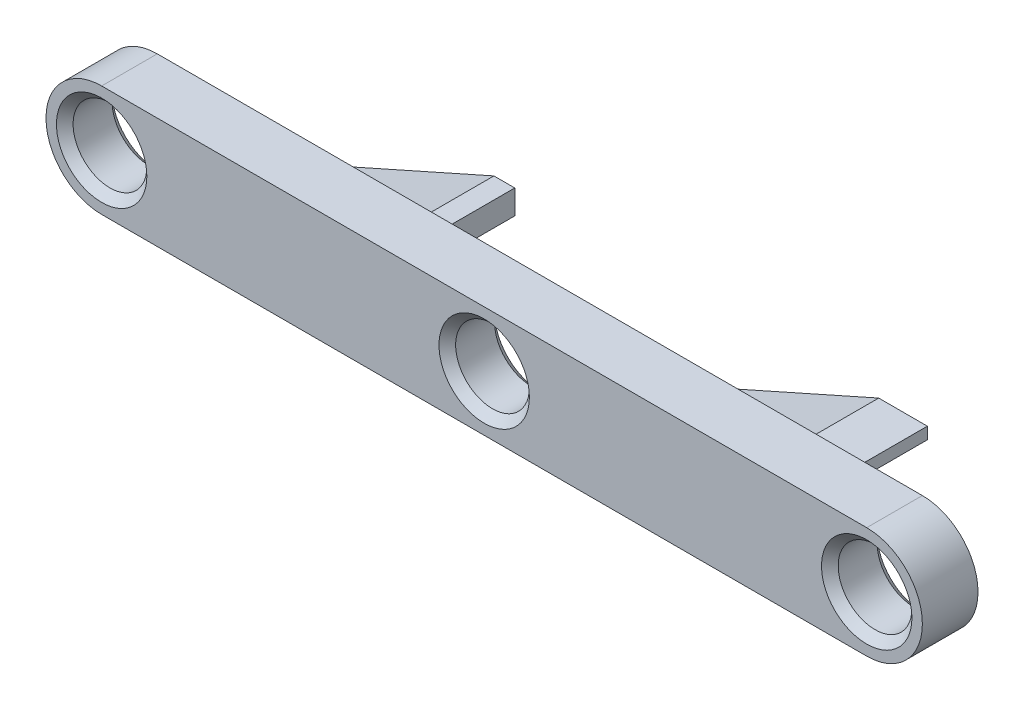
from build123d import *

# Parameters (mm, degrees)
BOSS_EXTRUDE1_DEPTH                      = 4
SKETCH2_R                                = 2.65
CUT_EXTRUDE1_DEPTH                       = 33.003906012
CHAMFER2_SIZE                            = 0.6
CHAMFER3_SIZE                            = 0.6
CHAMFER4_SIZE                            = 0.6
CHAMFER5_SIZE                            = 0.6
CHAMFER6_SIZE                            = 0.6
CHAMFER7_SIZE                            = 0.6
BOSS_EXTRUDE2_DEPTH                      = 4.7
MIRROR1_AT_THE_SECOND_PLANE_COPY_1_DEPTH = 4.7
CUT_EXTRUDE2_DEPTH                       = 4.7


with BuildPart() as part:
    # Sketch1 → Boss-Extrude1 (new body)
    with BuildSketch(Plane.XY):
        with BuildLine():
            Line((-27.5, 4), (27.5, 4))
            ThreePointArc((27.5, 4), (31.5, 0), (27.5, -4))
            Line((27.5, -4), (-27.5, -4))
            ThreePointArc((-27.5, -4), (-31.5, 0), (-27.5, 4))
        make_face()
    extrude(amount=BOSS_EXTRUDE1_DEPTH)

    # Sketch2 → Cut-Extrude1 (cut, through all)
    with BuildSketch(Plane.XY.offset(4)):
        with Locations((-27.5, 0)):
            Circle(SKETCH2_R)
        Circle(SKETCH2_R)
        with Locations((27.5, 0)):
            Circle(SKETCH2_R)
    extrude(amount=-CUT_EXTRUDE1_DEPTH, mode=Mode.SUBTRACT)

    # Chamfer2
    chamfer2_edges = [part.edges().sort_by_distance(p)[0] for p in [
        (-30.15, 0, 4),
    ]]
    chamfer(chamfer2_edges, length=CHAMFER2_SIZE)

    # Chamfer3
    chamfer3_edges = [part.edges().sort_by_distance(p)[0] for p in [
        (-30.15, 0, 0),
    ]]
    chamfer(chamfer3_edges, length=CHAMFER3_SIZE)

    # Chamfer4
    chamfer4_edges = [part.edges().sort_by_distance(p)[0] for p in [
        (-2.65, 0, 0),
    ]]
    chamfer(chamfer4_edges, length=CHAMFER4_SIZE)

    # Chamfer5
    chamfer5_edges = [part.edges().sort_by_distance(p)[0] for p in [
        (-2.65, 0, 4),
    ]]
    chamfer(chamfer5_edges, length=CHAMFER5_SIZE)

    # Chamfer6
    chamfer6_edges = [part.edges().sort_by_distance(p)[0] for p in [
        (24.85, 0, 0),
    ]]
    chamfer(chamfer6_edges, length=CHAMFER6_SIZE)

    # Chamfer7
    chamfer7_edges = [part.edges().sort_by_distance(p)[0] for p in [
        (24.85, 0, 4),
    ]]
    chamfer(chamfer7_edges, length=CHAMFER7_SIZE)

    # Sketch5 → Boss-Extrude2 (add)
    with BuildSketch(Plane(origin=(0, 0, 0), x_dir=(-1, 0, 0), z_dir=(0, 0, -1))):
        Polygon((-23.160974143, 3.8), (-23.160974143, 2.950100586), (-8, -3.8), (-6.5, -3.8), (-6.5, -2.059643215), (-19.660974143, 3.8), align=None)
    boss_extrude2 = extrude(amount=BOSS_EXTRUDE2_DEPTH)

    # Mirror1: Boss-Extrude2 across plane
    add(boss_extrude2.mirror(Plane.ZX))

    # Mirror1 at the second plane: Boss-Extrude2 across plane
    add(boss_extrude2.mirror(Plane(origin=(0, 0, 0), x_dir=(0, 0, 1), z_dir=(1, 0, 0))))

    # Mirror1 at the second plane copy 1 sketc → Mirror1 at the second plane copy 1 (add)
    with BuildSketch(Plane(origin=(0, 0, 0), x_dir=(1, 0, 0), z_dir=(0, 0, -1))):
        Polygon((-23.160974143, 3.8), (-23.160974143, 2.950100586), (-8, -3.8), (-6.5, -3.8), (-6.5, -2.059643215), (-19.660974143, 3.8), align=None)
    extrude(amount=MIRROR1_AT_THE_SECOND_PLANE_COPY_1_DEPTH)

    # Sketch6 → Cut-Extrude2 (cut)
    with BuildSketch(Plane(origin=(0, 0, -4.7), x_dir=(-1, 0, 0), z_dir=(0, 0, -1))):
        Polygon((-15.104761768, 1.771443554), (-8.751545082, -1.057190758), (-4.110286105, 2.51311457), (-7.246807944, 7.601438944), align=None)
        Polygon((-17.626641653, 0.486057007), (-11.719631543, -2.143913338), (-16.648904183, -6.318754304), (-25.764538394, -5.234239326), (-21.9821284, -0.188886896), align=None)
        Polygon((8.58421018, 1.131693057), (14.703742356, -1.592898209), (6.44241206, -5.612978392), (4.525753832, -0.382775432), align=None)
        Polygon((11.983222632, 2.026555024), (17.758594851, -0.544806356), (24.258021, 3.436897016), (16.813955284, 7.91240132), align=None)
    extrude(amount=-CUT_EXTRUDE2_DEPTH, mode=Mode.SUBTRACT)


solid = part.part
